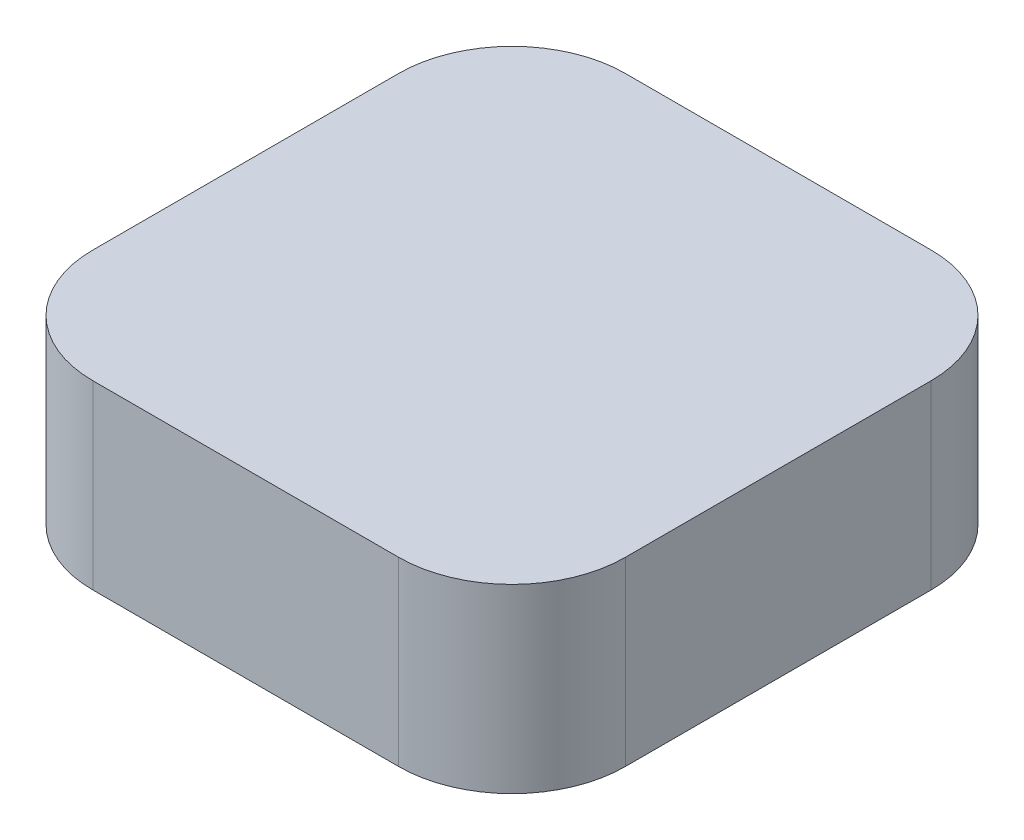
ISO-10303-21;
HEADER;
FILE_DESCRIPTION(('STEP AP214'),'2;1');
FILE_NAME('part.step','',(''),(''),'','','');
FILE_SCHEMA(('AUTOMOTIVE_DESIGN { 1 0 10303 214 1 1 1 1 }'));
ENDSEC;
DATA;
#1=APPLICATION_CONTEXT('core data for automotive mechanical design processes');
#2=APPLICATION_PROTOCOL_DEFINITION('international standard','automotive_design',2000,#1);
#3=PRODUCT_CONTEXT('',#1,'mechanical');
#4=PRODUCT('Part','Part','',(#3));
#5=PRODUCT_RELATED_PRODUCT_CATEGORY('part','',(#4));
#6=PRODUCT_DEFINITION_FORMATION('','',#4);
#7=PRODUCT_DEFINITION_CONTEXT('part definition',#1,'design');
#8=PRODUCT_DEFINITION('design','',#6,#7);
#9=PRODUCT_DEFINITION_SHAPE('','',#8);
#10=(LENGTH_UNIT() NAMED_UNIT(*) SI_UNIT(.MILLI.,.METRE.));
#11=(NAMED_UNIT(*) PLANE_ANGLE_UNIT() SI_UNIT($,.RADIAN.));
#12=(NAMED_UNIT(*) SI_UNIT($,.STERADIAN.) SOLID_ANGLE_UNIT());
#13=UNCERTAINTY_MEASURE_WITH_UNIT(LENGTH_MEASURE(1.E-05),#10,'distance_accuracy_value','');
#14=(GEOMETRIC_REPRESENTATION_CONTEXT(3) GLOBAL_UNCERTAINTY_ASSIGNED_CONTEXT((#13)) GLOBAL_UNIT_ASSIGNED_CONTEXT((#10,
#11,#12)) REPRESENTATION_CONTEXT('',''));
#15=CARTESIAN_POINT('',(0.,0.,0.));
#16=DIRECTION('',(0.,0.,1.));
#17=DIRECTION('',(1.,0.,0.));
#18=AXIS2_PLACEMENT_3D('',#15,#16,#17);
#19=CARTESIAN_POINT('',(2.35,1.6,2.35));
#20=DIRECTION('',(-1.,0.,0.));
#21=DIRECTION('',(0.,0.,1.));
#22=AXIS2_PLACEMENT_3D('',#19,#20,#21);
#23=PLANE('',#22);
#24=DIRECTION('',(0.,0.,-1.));
#25=VECTOR('',#24,1.);
#26=CARTESIAN_POINT('',(2.35,0.,2.35));
#27=LINE('',#26,#25);
#28=CARTESIAN_POINT('',(2.35,0.,1.35));
#29=VERTEX_POINT('',#28);
#30=CARTESIAN_POINT('',(2.35,0.,-1.35));
#31=VERTEX_POINT('',#30);
#32=EDGE_CURVE('E132',#29,#31,#27,.T.);
#33=ORIENTED_EDGE('',*,*,#32,.T.);
#34=DIRECTION('',(0.,-1.,0.));
#35=VECTOR('',#34,1.);
#36=CARTESIAN_POINT('',(2.35,1.6,-1.35));
#37=LINE('',#36,#35);
#38=CARTESIAN_POINT('',(2.35,1.6,-1.35));
#39=VERTEX_POINT('',#38);
#40=EDGE_CURVE('E11',#31,#39,#37,.F.);
#41=ORIENTED_EDGE('',*,*,#40,.T.);
#42=DIRECTION('',(0.,0.,-1.));
#43=VECTOR('',#42,1.);
#44=CARTESIAN_POINT('',(2.35,1.6,2.35));
#45=LINE('',#44,#43);
#46=CARTESIAN_POINT('',(2.35,1.6,1.35));
#47=VERTEX_POINT('',#46);
#48=EDGE_CURVE('E130',#47,#39,#45,.T.);
#49=ORIENTED_EDGE('',*,*,#48,.F.);
#50=DIRECTION('',(0.,-1.,0.));
#51=VECTOR('',#50,1.);
#52=CARTESIAN_POINT('',(2.35,1.6,1.35));
#53=LINE('',#52,#51);
#54=EDGE_CURVE('E44',#47,#29,#53,.T.);
#55=ORIENTED_EDGE('',*,*,#54,.T.);
#56=EDGE_LOOP('',(#33,#41,#49,#55));
#57=FACE_BOUND('',#56,.T.);
#58=ADVANCED_FACE('F36',(#57),#23,.F.);
#59=CARTESIAN_POINT('',(-2.35,1.6,-2.35));
#60=DIRECTION('',(0.,0.,1.));
#61=DIRECTION('',(1.,0.,0.));
#62=AXIS2_PLACEMENT_3D('',#59,#60,#61);
#63=PLANE('',#62);
#64=DIRECTION('',(-1.,0.,0.));
#65=VECTOR('',#64,1.);
#66=CARTESIAN_POINT('',(-2.35,0.,-2.35));
#67=LINE('',#66,#65);
#68=CARTESIAN_POINT('',(1.35,0.,-2.35));
#69=VERTEX_POINT('',#68);
#70=CARTESIAN_POINT('',(-1.35,0.,-2.35));
#71=VERTEX_POINT('',#70);
#72=EDGE_CURVE('E128',#69,#71,#67,.T.);
#73=ORIENTED_EDGE('',*,*,#72,.T.);
#74=DIRECTION('',(0.,-1.,0.));
#75=VECTOR('',#74,1.);
#76=CARTESIAN_POINT('',(-1.35,1.6,-2.35));
#77=LINE('',#76,#75);
#78=CARTESIAN_POINT('',(-1.35,1.6,-2.35));
#79=VERTEX_POINT('',#78);
#80=EDGE_CURVE('E107',#71,#79,#77,.F.);
#81=ORIENTED_EDGE('',*,*,#80,.T.);
#82=DIRECTION('',(-1.,0.,0.));
#83=VECTOR('',#82,1.);
#84=CARTESIAN_POINT('',(-2.35,1.6,-2.35));
#85=LINE('',#84,#83);
#86=CARTESIAN_POINT('',(1.35,1.6,-2.35));
#87=VERTEX_POINT('',#86);
#88=EDGE_CURVE('E168',#87,#79,#85,.T.);
#89=ORIENTED_EDGE('',*,*,#88,.F.);
#90=DIRECTION('',(0.,-1.,0.));
#91=VECTOR('',#90,1.);
#92=CARTESIAN_POINT('',(1.35,1.6,-2.35));
#93=LINE('',#92,#91);
#94=EDGE_CURVE('E112',#87,#69,#93,.T.);
#95=ORIENTED_EDGE('',*,*,#94,.T.);
#96=EDGE_LOOP('',(#73,#81,#89,#95));
#97=FACE_BOUND('',#96,.T.);
#98=ADVANCED_FACE('F178',(#97),#63,.F.);
#99=CARTESIAN_POINT('',(-2.35,1.6,2.35));
#100=DIRECTION('',(1.,0.,0.));
#101=DIRECTION('',(0.,0.,-1.));
#102=AXIS2_PLACEMENT_3D('',#99,#100,#101);
#103=PLANE('',#102);
#104=DIRECTION('',(0.,0.,1.));
#105=VECTOR('',#104,1.);
#106=CARTESIAN_POINT('',(-2.35,1.6,2.35));
#107=LINE('',#106,#105);
#108=CARTESIAN_POINT('',(-2.35,1.6,-1.35));
#109=VERTEX_POINT('',#108);
#110=CARTESIAN_POINT('',(-2.35,1.6,1.35));
#111=VERTEX_POINT('',#110);
#112=EDGE_CURVE('E121',#109,#111,#107,.T.);
#113=ORIENTED_EDGE('',*,*,#112,.F.);
#114=DIRECTION('',(0.,-1.,0.));
#115=VECTOR('',#114,1.);
#116=CARTESIAN_POINT('',(-2.35,1.6,-1.35));
#117=LINE('',#116,#115);
#118=CARTESIAN_POINT('',(-2.35,0.,-1.35));
#119=VERTEX_POINT('',#118);
#120=EDGE_CURVE('E106',#109,#119,#117,.T.);
#121=ORIENTED_EDGE('',*,*,#120,.T.);
#122=DIRECTION('',(0.,0.,1.));
#123=VECTOR('',#122,1.);
#124=CARTESIAN_POINT('',(-2.35,0.,2.35));
#125=LINE('',#124,#123);
#126=CARTESIAN_POINT('',(-2.35,0.,1.35));
#127=VERTEX_POINT('',#126);
#128=EDGE_CURVE('E119',#119,#127,#125,.T.);
#129=ORIENTED_EDGE('',*,*,#128,.T.);
#130=DIRECTION('',(0.,-1.,0.));
#131=VECTOR('',#130,1.);
#132=CARTESIAN_POINT('',(-2.35,1.6,1.35));
#133=LINE('',#132,#131);
#134=EDGE_CURVE('E123',#127,#111,#133,.F.);
#135=ORIENTED_EDGE('',*,*,#134,.T.);
#136=EDGE_LOOP('',(#113,#121,#129,#135));
#137=FACE_BOUND('',#136,.T.);
#138=ADVANCED_FACE('F118',(#137),#103,.F.);
#139=CARTESIAN_POINT('',(-2.35,1.6,2.35));
#140=DIRECTION('',(0.,0.,-1.));
#141=DIRECTION('',(-1.,0.,0.));
#142=AXIS2_PLACEMENT_3D('',#139,#140,#141);
#143=PLANE('',#142);
#144=DIRECTION('',(1.,0.,0.));
#145=VECTOR('',#144,1.);
#146=CARTESIAN_POINT('',(-2.35,1.6,2.35));
#147=LINE('',#146,#145);
#148=CARTESIAN_POINT('',(-1.35,1.6,2.35));
#149=VERTEX_POINT('',#148);
#150=CARTESIAN_POINT('',(1.35,1.6,2.35));
#151=VERTEX_POINT('',#150);
#152=EDGE_CURVE('E136',#149,#151,#147,.T.);
#153=ORIENTED_EDGE('',*,*,#152,.F.);
#154=DIRECTION('',(0.,-1.,0.));
#155=VECTOR('',#154,1.);
#156=CARTESIAN_POINT('',(-1.35,1.6,2.35));
#157=LINE('',#156,#155);
#158=CARTESIAN_POINT('',(-1.35,0.,2.35));
#159=VERTEX_POINT('',#158);
#160=EDGE_CURVE('E153',#149,#159,#157,.T.);
#161=ORIENTED_EDGE('',*,*,#160,.T.);
#162=DIRECTION('',(1.,0.,0.));
#163=VECTOR('',#162,1.);
#164=CARTESIAN_POINT('',(-2.35,0.,2.35));
#165=LINE('',#164,#163);
#166=CARTESIAN_POINT('',(1.35,0.,2.35));
#167=VERTEX_POINT('',#166);
#168=EDGE_CURVE('E127',#159,#167,#165,.T.);
#169=ORIENTED_EDGE('',*,*,#168,.T.);
#170=DIRECTION('',(0.,-1.,0.));
#171=VECTOR('',#170,1.);
#172=CARTESIAN_POINT('',(1.35,1.6,2.35));
#173=LINE('',#172,#171);
#174=EDGE_CURVE('E51',#167,#151,#173,.F.);
#175=ORIENTED_EDGE('',*,*,#174,.T.);
#176=EDGE_LOOP('',(#153,#161,#169,#175));
#177=FACE_BOUND('',#176,.T.);
#178=ADVANCED_FACE('F182',(#177),#143,.F.);
#179=CARTESIAN_POINT('',(0.,1.6,0.));
#180=DIRECTION('',(0.,-1.,0.));
#181=DIRECTION('',(0.,0.,-1.));
#182=AXIS2_PLACEMENT_3D('',#179,#180,#181);
#183=PLANE('',#182);
#184=ORIENTED_EDGE('',*,*,#88,.T.);
#185=CARTESIAN_POINT('',(-1.35,1.6,-1.35));
#186=DIRECTION('',(0.,-1.,0.));
#187=DIRECTION('',(0.,0.,-1.));
#188=AXIS2_PLACEMENT_3D('',#185,#186,#187);
#189=CIRCLE('',#188,1.);
#190=EDGE_CURVE('E150',#79,#109,#189,.F.);
#191=ORIENTED_EDGE('',*,*,#190,.T.);
#192=ORIENTED_EDGE('',*,*,#112,.T.);
#193=CARTESIAN_POINT('',(-1.35,1.6,1.35));
#194=DIRECTION('',(0.,-1.,0.));
#195=DIRECTION('',(0.,0.,-1.));
#196=AXIS2_PLACEMENT_3D('',#193,#194,#195);
#197=CIRCLE('',#196,1.);
#198=EDGE_CURVE('E58',#111,#149,#197,.F.);
#199=ORIENTED_EDGE('',*,*,#198,.T.);
#200=ORIENTED_EDGE('',*,*,#152,.T.);
#201=CARTESIAN_POINT('',(1.35,1.6,1.35));
#202=DIRECTION('',(0.,-1.,0.));
#203=DIRECTION('',(0.,0.,-1.));
#204=AXIS2_PLACEMENT_3D('',#201,#202,#203);
#205=CIRCLE('',#204,1.);
#206=EDGE_CURVE('E145',#151,#47,#205,.F.);
#207=ORIENTED_EDGE('',*,*,#206,.T.);
#208=ORIENTED_EDGE('',*,*,#48,.T.);
#209=CARTESIAN_POINT('',(1.35,1.6,-1.35));
#210=DIRECTION('',(0.,-1.,0.));
#211=DIRECTION('',(0.,0.,-1.));
#212=AXIS2_PLACEMENT_3D('',#209,#210,#211);
#213=CIRCLE('',#212,1.);
#214=EDGE_CURVE('E147',#39,#87,#213,.F.);
#215=ORIENTED_EDGE('',*,*,#214,.T.);
#216=EDGE_LOOP('',(#184,#191,#192,#199,#200,#207,#208,#215));
#217=FACE_BOUND('',#216,.T.);
#218=ADVANCED_FACE('F172',(#217),#183,.F.);
#219=CARTESIAN_POINT('',(0.,0.,0.));
#220=DIRECTION('',(0.,-1.,0.));
#221=DIRECTION('',(0.,0.,-1.));
#222=AXIS2_PLACEMENT_3D('',#219,#220,#221);
#223=PLANE('',#222);
#224=ORIENTED_EDGE('',*,*,#128,.F.);
#225=CARTESIAN_POINT('',(-1.35,0.,-1.35));
#226=DIRECTION('',(0.,-1.,0.));
#227=DIRECTION('',(0.,0.,-1.));
#228=AXIS2_PLACEMENT_3D('',#225,#226,#227);
#229=CIRCLE('',#228,1.);
#230=EDGE_CURVE('E102',#119,#71,#229,.T.);
#231=ORIENTED_EDGE('',*,*,#230,.T.);
#232=ORIENTED_EDGE('',*,*,#72,.F.);
#233=CARTESIAN_POINT('',(1.35,0.,-1.35));
#234=DIRECTION('',(0.,-1.,0.));
#235=DIRECTION('',(0.,0.,-1.));
#236=AXIS2_PLACEMENT_3D('',#233,#234,#235);
#237=CIRCLE('',#236,1.);
#238=EDGE_CURVE('E139',#69,#31,#237,.T.);
#239=ORIENTED_EDGE('',*,*,#238,.T.);
#240=ORIENTED_EDGE('',*,*,#32,.F.);
#241=CARTESIAN_POINT('',(1.35,0.,1.35));
#242=DIRECTION('',(0.,-1.,0.));
#243=DIRECTION('',(0.,0.,-1.));
#244=AXIS2_PLACEMENT_3D('',#241,#242,#243);
#245=CIRCLE('',#244,1.);
#246=EDGE_CURVE('E122',#29,#167,#245,.T.);
#247=ORIENTED_EDGE('',*,*,#246,.T.);
#248=ORIENTED_EDGE('',*,*,#168,.F.);
#249=CARTESIAN_POINT('',(-1.35,0.,1.35));
#250=DIRECTION('',(0.,-1.,0.));
#251=DIRECTION('',(0.,0.,-1.));
#252=AXIS2_PLACEMENT_3D('',#249,#250,#251);
#253=CIRCLE('',#252,1.);
#254=EDGE_CURVE('E113',#159,#127,#253,.T.);
#255=ORIENTED_EDGE('',*,*,#254,.T.);
#256=EDGE_LOOP('',(#224,#231,#232,#239,#240,#247,#248,#255));
#257=FACE_BOUND('',#256,.T.);
#258=ADVANCED_FACE('F125',(#257),#223,.T.);
#259=CARTESIAN_POINT('',(-1.35,1.6,-1.35));
#260=DIRECTION('',(0.,-1.,0.));
#261=DIRECTION('',(0.,0.,-1.));
#262=AXIS2_PLACEMENT_3D('',#259,#260,#261);
#263=CYLINDRICAL_SURFACE('',#262,1.);
#264=ORIENTED_EDGE('',*,*,#190,.F.);
#265=ORIENTED_EDGE('',*,*,#80,.F.);
#266=ORIENTED_EDGE('',*,*,#230,.F.);
#267=ORIENTED_EDGE('',*,*,#120,.F.);
#268=EDGE_LOOP('',(#264,#265,#266,#267));
#269=FACE_BOUND('',#268,.T.);
#270=ADVANCED_FACE('F105',(#269),#263,.T.);
#271=CARTESIAN_POINT('',(-1.35,1.6,1.35));
#272=DIRECTION('',(0.,-1.,0.));
#273=DIRECTION('',(0.,0.,-1.));
#274=AXIS2_PLACEMENT_3D('',#271,#272,#273);
#275=CYLINDRICAL_SURFACE('',#274,1.);
#276=ORIENTED_EDGE('',*,*,#198,.F.);
#277=ORIENTED_EDGE('',*,*,#134,.F.);
#278=ORIENTED_EDGE('',*,*,#254,.F.);
#279=ORIENTED_EDGE('',*,*,#160,.F.);
#280=EDGE_LOOP('',(#276,#277,#278,#279));
#281=FACE_BOUND('',#280,.T.);
#282=ADVANCED_FACE('F181',(#281),#275,.T.);
#283=CARTESIAN_POINT('',(1.35,1.6,-1.35));
#284=DIRECTION('',(0.,-1.,0.));
#285=DIRECTION('',(0.,0.,-1.));
#286=AXIS2_PLACEMENT_3D('',#283,#284,#285);
#287=CYLINDRICAL_SURFACE('',#286,1.);
#288=ORIENTED_EDGE('',*,*,#214,.F.);
#289=ORIENTED_EDGE('',*,*,#40,.F.);
#290=ORIENTED_EDGE('',*,*,#238,.F.);
#291=ORIENTED_EDGE('',*,*,#94,.F.);
#292=EDGE_LOOP('',(#288,#289,#290,#291));
#293=FACE_BOUND('',#292,.T.);
#294=ADVANCED_FACE('F176',(#293),#287,.T.);
#295=CARTESIAN_POINT('',(1.35,1.6,1.35));
#296=DIRECTION('',(0.,-1.,0.));
#297=DIRECTION('',(0.,0.,-1.));
#298=AXIS2_PLACEMENT_3D('',#295,#296,#297);
#299=CYLINDRICAL_SURFACE('',#298,1.);
#300=ORIENTED_EDGE('',*,*,#206,.F.);
#301=ORIENTED_EDGE('',*,*,#174,.F.);
#302=ORIENTED_EDGE('',*,*,#246,.F.);
#303=ORIENTED_EDGE('',*,*,#54,.F.);
#304=EDGE_LOOP('',(#300,#301,#302,#303));
#305=FACE_BOUND('',#304,.T.);
#306=ADVANCED_FACE('F38',(#305),#299,.T.);
#307=CLOSED_SHELL('',(#58,#98,#138,#178,#218,#258,#270,#282,#294,#306));
#308=MANIFOLD_SOLID_BREP('B2',#307);
#309=ADVANCED_BREP_SHAPE_REPRESENTATION('',(#18,#308),#14);
#310=SHAPE_DEFINITION_REPRESENTATION(#9,#309);
ENDSEC;
END-ISO-10303-21;
